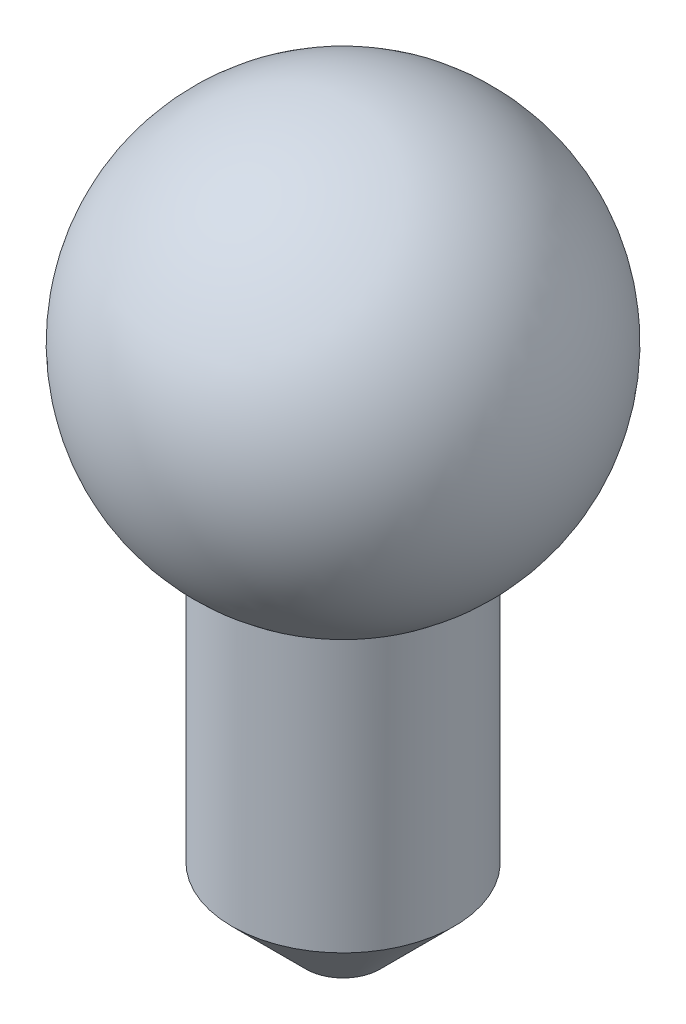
from build123d import *


with BuildPart() as part:
    # Esquisse1 → R_volution4 (revolve)
    with BuildSketch(Plane.XY):
        with BuildLine():
            Line((-4.5, 0), (-4.5, -11))
            Line((-4.5, -11), (-1.5, -14))
            Line((-1.5, -14), (0, -14))
            Line((0, -14), (0, 15.711102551))
            ThreePointArc((0, 15.711102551), (-8.171424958, 9.551575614), (-4.5, 0))
        make_face()
    revolve(axis=Axis((0, -72.482028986, 0), (0, 1, 0)))


solid = part.part
